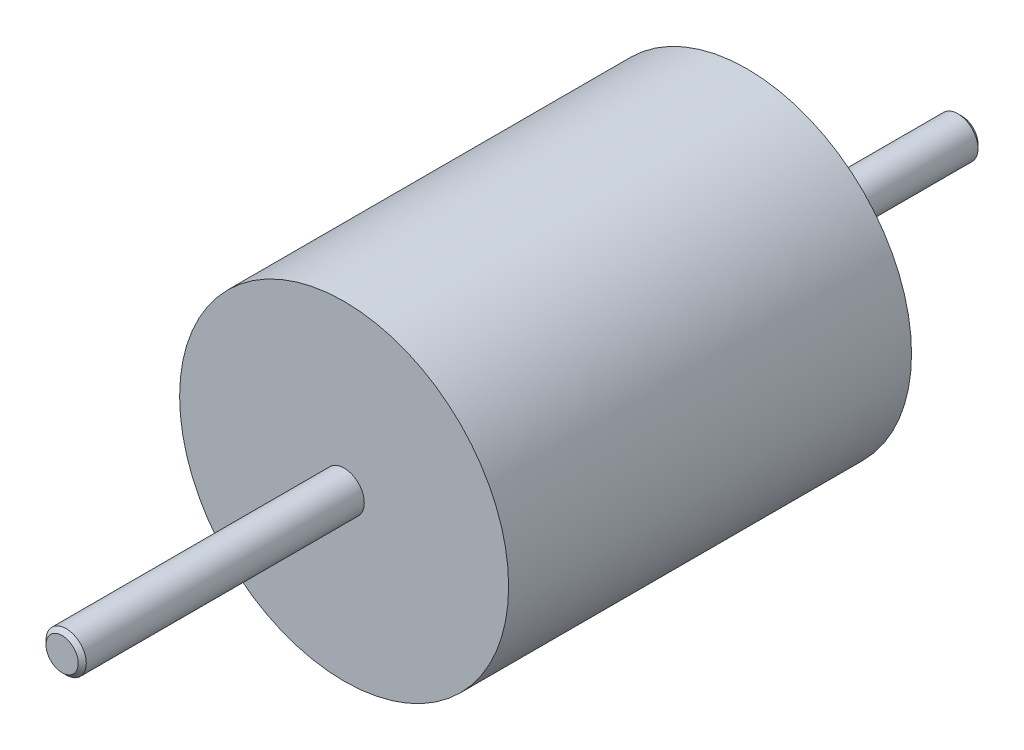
from build123d import *

# Parameters (mm, degrees)
SKETCH1_R           = 1.5
BOSS_EXTRUDE1_DEPTH = 33.5
SKETCH2_R           = 12.25
SKETCH2_R_2         = 1.5
BOSS_EXTRUDE2_DEPTH = 30
CHAMFER1_SIZE       = 0.3


with BuildPart() as part:
    # Sketch1 → Boss-Extrude1 (new, symmetric)
    with BuildSketch(Plane.XY):
        Circle(SKETCH1_R)
    extrude(amount=BOSS_EXTRUDE1_DEPTH, both=True)

    # Sketch2 → Boss-Extrude2 (add)
    with BuildSketch(Plane.XY.offset(12.5)):
        Circle(SKETCH2_R)
        Circle(SKETCH2_R_2, mode=Mode.SUBTRACT)
    extrude(amount=-BOSS_EXTRUDE2_DEPTH)

    # Chamfer1
    chamfer1_edges = [part.edges().sort_by_distance(p)[0] for p in [
        (-1.5, 0, -33.5),
        (-1.5, 0, 33.5),
    ]]
    chamfer(chamfer1_edges, length=CHAMFER1_SIZE)


solid = part.part
